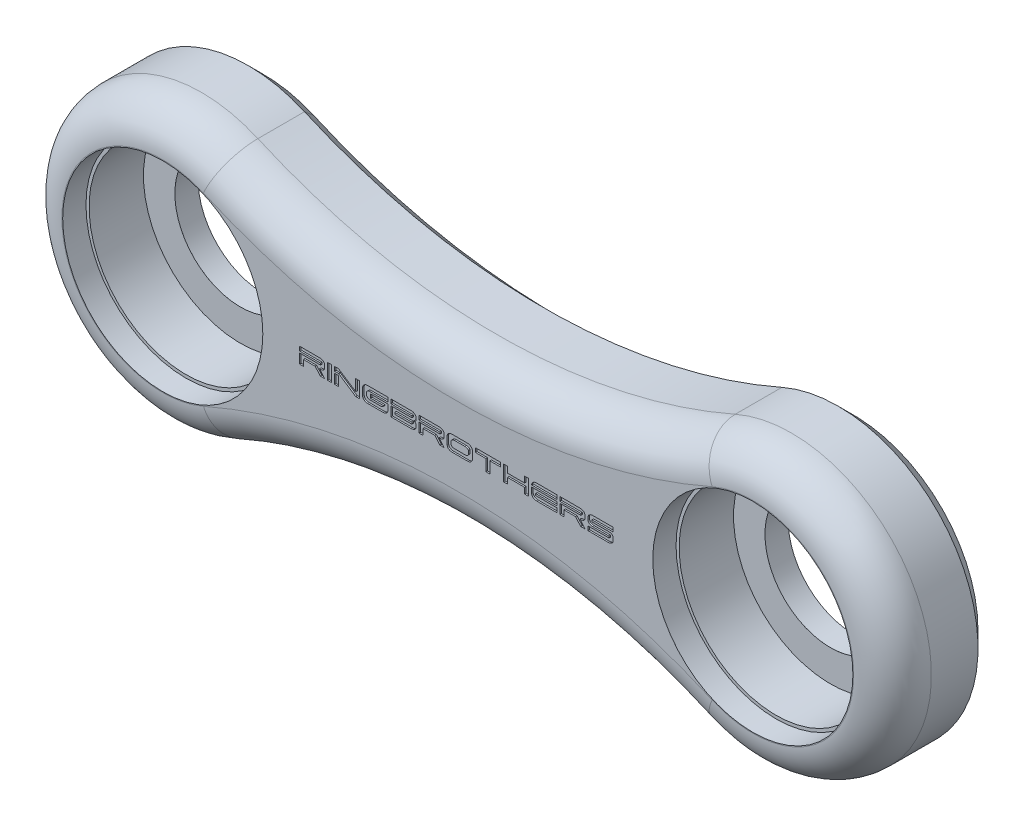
from build123d import *

# Parameters (mm, degrees)
SKETCH1_R                       = 5.3594
MAIN_BODY_DOG_BONE_DEPTH        = 8.255
SKETCH2_R                       = 7.93115
R4ZZ_BEARIN_BORE_3_DEEP_DEPTH   = 6.35
SKETCH3_R                       = 8.18515
F_105_DEEP_CLEARANCE_BORE_DEPTH = 1.905
F_02_X_45_DEG_CHAMFERS_SIZE     = 0.000254
F_125_FILLETS_R                 = 3.175
CHAMFER1_SIZE                   = 1.27
EXTRUDE2_DEPTH                  = 0.127


with BuildPart() as part:
    # Sketch1 → Main Body Dog Bone (new body)
    with BuildSketch(Plane.XY):
        with BuildLine():
            ThreePointArc((4.608381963, 10.459814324), (-11.43, 0), (4.608381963, -10.459814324))
            ThreePointArc((4.608381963, -10.459814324), (24.13, -6.35), (43.651618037, -10.459814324))
            ThreePointArc((43.651618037, -10.459814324), (59.69, 0), (43.651618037, 10.459814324))
            ThreePointArc((43.651618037, 10.459814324), (24.13, 6.35), (4.608381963, 10.459814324))
        make_face()
        Circle(SKETCH1_R, mode=Mode.SUBTRACT)
        with Locations((48.26, 0)):
            Circle(SKETCH1_R, mode=Mode.SUBTRACT)
    extrude(amount=-MAIN_BODY_DOG_BONE_DEPTH)

    # Sketch2 → R4ZZ bearin bore .3_ deep (cut)
    with BuildSketch(Plane.XY):
        Circle(SKETCH2_R)
        with Locations((48.26, 0)):
            Circle(SKETCH2_R)
    extrude(amount=-R4ZZ_BEARIN_BORE_3_DEEP_DEPTH, mode=Mode.SUBTRACT)

    # Sketch3 → 105_ deep Clearance Bore (cut)
    with BuildSketch(Plane.XY):
        Circle(SKETCH3_R)
        with Locations((48.26, 0)):
            Circle(SKETCH3_R)
    extrude(amount=-F_105_DEEP_CLEARANCE_BORE_DEPTH, mode=Mode.SUBTRACT)

    # 02_ x 45 deg chamfers
    f_02_x_45_deg_chamfers_edges = [part.edges().sort_by_distance(p)[0] for p in [
        (-5.3594, 0, -8.255),
        (42.9006, 0, -8.255),
        (-5.3594, 0, -6.35),
        (42.9006, 0, -6.35),
        (-8.18515, 0, 0),
        (40.07485, 0, 0),
    ]]
    chamfer(f_02_x_45_deg_chamfers_edges, length=F_02_X_45_DEG_CHAMFERS_SIZE)

    # 125_ Fillets
    f_125_fillets_edges = [part.edges().sort_by_distance(p)[0] for p in [
        (59.69, 0, 0),
        (24.13, -6.35, 0),
        (-11.43, 0, 0),
        (24.13, 6.35, 0),
    ]]
    fillet(f_125_fillets_edges, radius=F_125_FILLETS_R)

    # Chamfer1
    chamfer1_edges = [part.edges().sort_by_distance(p)[0] for p in [
        (24.13, -6.35, -8.255),
        (59.69, 0, -8.255),
        (24.13, 6.35, -8.255),
        (-11.43, 0, -8.255),
    ]]
    chamfer(chamfer1_edges, length=CHAMFER1_SIZE)

    # Sketch5 → Extrude2 (cut)
    # profile 1 of 14: a face of its own
    with BuildSketch(Plane.XY):
        with BuildLine():
            Line((12.466708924, -0.146319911), (11.506711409, -0.146319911))
            Line((11.506711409, -0.146319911), (11.506711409, -0.290272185))
            Line((11.506711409, -0.290272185), (11.506711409, -0.635))
            Line((11.506711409, -0.635), (11.179346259, -0.635))
            Line((11.179346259, -0.635), (11.179346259, -0.318683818))
            Line((11.179346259, -0.318683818), (11.179346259, 0.1548434))
            Line((11.179346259, 0.1548434), (12.898881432, 0.1548434))
            Line((12.898881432, 0.1548434), (12.898881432, 0.298795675))
            Line((12.898881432, 0.298795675), (11.179346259, 0.298795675))
            Line((11.179346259, 0.298795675), (11.179346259, 0.635))
            Line((11.179346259, 0.635), (11.591630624, 0.635))
            Line((11.591630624, 0.635), (12.826905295, 0.632790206))
            add(Edge.make_bspline(
                [(12.826905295, 0.632790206), (12.841328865, 0.632663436), (12.869589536, 0.632415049), (12.911034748, 0.628849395), (12.950727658, 0.622943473), (12.988578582, 0.614232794), (13.024483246, 0.602324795), (13.058730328, 0.588280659), (13.090954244, 0.571066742), (13.121384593, 0.551623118), (13.149139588, 0.529418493), (13.173383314, 0.50430363), (13.193784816, 0.476450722), (13.210724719, 0.446104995), (13.223099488, 0.41277572), (13.232892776, 0.377251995), (13.238049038, 0.338827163), (13.238802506, 0.312383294), (13.239189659, 0.298795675)],
                knots=[0, 0, 0, 0, 1.152257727, 2.257664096, 3.320814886, 4.356953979, 5.356767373, 6.340576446, 7.311035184, 8.2719758, 9.22274549, 10.144516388, 11.052686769, 11.974764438, 12.91171314, 13.886678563, 14.914114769, 16, 16, 16, 16], degree=3))
            Line((13.239189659, 0.298795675), (13.239189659, 0.1548434))
            add(Edge.make_bspline(
                [(13.239189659, 0.1548434), (13.238947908, 0.141564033), (13.238479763, 0.115848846), (13.233161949, 0.078898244), (13.225591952, 0.044798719), (13.214140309, 0.013775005), (13.19921045, -0.014035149), (13.181486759, -0.039181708), (13.159948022, -0.060743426), (13.13545111, -0.079597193), (13.107473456, -0.095218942), (13.076781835, -0.109372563), (13.042447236, -0.120408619), (13.00512119, -0.12987551), (12.964642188, -0.137447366), (12.920885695, -0.142713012), (12.873884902, -0.145888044), (12.84143201, -0.146172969), (12.824695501, -0.146319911)],
                knots=[0, 0, 0, 0, 1.081306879, 2.093925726, 3.036167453, 3.923384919, 4.778872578, 5.602256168, 6.420848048, 7.252672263, 8.11313074, 9.02648445, 10.002685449, 11.046731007, 12.163464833, 13.355767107, 14.636324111, 16, 16, 16, 16], degree=3))
            Line((12.824695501, -0.146319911), (13.239189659, -0.635))
            Line((13.239189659, -0.635), (12.881203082, -0.635))
            Line((12.881203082, -0.635), (12.466708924, -0.146319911))
        make_face()
    # profile 2 of 14: a face of its own
    with BuildSketch(Plane.XY):
        Polygon((13.8099478, -0.635), (13.48258265, -0.635), (13.48258265, 0.298795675), (13.48258265, 0.635), (13.8099478, 0.635), (13.8099478, 0.298795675), (13.8099478, 0.159262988), (13.8099478, -0.115698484), align=None)
    # profile 3 of 14: a face of its own
    with BuildSketch(Plane.XY):
        Polygon((14.384178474, 0.635), (14.048289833, 0.635), (14.048289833, 0.298795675), (14.380074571, 0.298795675), (15.780768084, -0.635), (16.108133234, -0.635), (16.108133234, -0.318683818), (16.108133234, 0.635), (15.780768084, 0.635), (15.780768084, 0.146004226), (15.780768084, -0.290272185), align=None)
    # profile 4 of 14: a face of its own
    with BuildSketch(Plane.XY):
        Polygon((14.375654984, 0.146004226), (14.375654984, -0.168102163), (14.375654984, -0.635), (14.048289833, -0.635), (14.048289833, 0.146004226), align=None)
    # profile 5 of 14: a face of its own
    with BuildSketch(Plane.XY):
        with BuildLine():
            Line((18.411369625, 0.1548434), (18.411369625, -0.146319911))
            Line((18.411369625, -0.146319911), (18.411369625, -0.318683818))
            add(Edge.make_bspline(
                [(18.411369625, -0.318683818), (18.411038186, -0.329448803), (18.410386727, -0.350607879), (18.404217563, -0.381682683), (18.395457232, -0.411808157), (18.38164896, -0.440359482), (18.36515046, -0.468162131), (18.343673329, -0.493958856), (18.319592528, -0.519418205), (18.291415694, -0.542814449), (18.260868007, -0.564277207), (18.228523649, -0.583541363), (18.194254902, -0.5992309), (18.158322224, -0.612192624), (18.120904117, -0.622661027), (18.08171987, -0.62995919), (18.040944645, -0.633954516), (18.013194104, -0.634647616), (17.99908526, -0.635)],
                knots=[0, 0, 0, 0, 0.896373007, 1.761862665, 2.633245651, 3.504540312, 4.398247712, 5.321687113, 6.295784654, 7.31682771, 8.368284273, 9.406444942, 10.45051942, 11.505082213, 12.588443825, 13.686201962, 14.823625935, 16, 16, 16, 16], degree=3))
            Line((17.99908526, -0.635), (16.763810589, -0.635))
            add(Edge.make_bspline(
                [(16.763810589, -0.635), (16.749701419, -0.634648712), (16.721950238, -0.633957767), (16.68117964, -0.629946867), (16.642078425, -0.622723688), (16.604720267, -0.612064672), (16.568716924, -0.599313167), (16.534375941, -0.583530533), (16.502026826, -0.564280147), (16.47148042, -0.542813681), (16.443303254, -0.519418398), (16.419222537, -0.493958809), (16.397745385, -0.468162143), (16.38124689, -0.440359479), (16.367438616, -0.411808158), (16.358678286, -0.381682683), (16.352509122, -0.350607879), (16.351857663, -0.329448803), (16.351526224, -0.318683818)],
                knots=[0, 0, 0, 0, 1.176388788, 2.313826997, 3.411598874, 4.486522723, 5.549349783, 6.593437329, 7.631610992, 8.683080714, 9.70413655, 10.678246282, 11.601697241, 12.495415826, 13.366721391, 14.238115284, 15.103615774, 16, 16, 16, 16], degree=3))
            Line((16.351526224, -0.318683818), (16.351526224, 0.318683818))
            add(Edge.make_bspline(
                [(16.351526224, 0.318683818), (16.351869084, 0.329446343), (16.35254629, 0.350704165), (16.358576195, 0.381814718), (16.367519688, 0.411885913), (16.381219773, 0.440377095), (16.397860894, 0.468173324), (16.419003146, 0.494257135), (16.443437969, 0.519395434), (16.471458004, 0.542836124), (16.502035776, 0.564265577), (16.534362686, 0.583565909), (16.56879449, 0.599199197), (16.60459244, 0.612570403), (16.642146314, 0.622591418), (16.681168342, 0.629985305), (16.721953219, 0.633947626), (16.749702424, 0.634645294), (16.763810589, 0.635)],
                knots=[0, 0, 0, 0, 0.896302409, 1.770350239, 2.633278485, 3.504504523, 4.398141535, 5.328358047, 6.296077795, 7.317040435, 8.368414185, 9.406493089, 10.450485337, 11.516216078, 12.588712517, 13.686384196, 14.823718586, 16, 16, 16, 16], degree=3))
            Line((16.763810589, 0.635), (18.411369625, 0.635))
            Line((18.411369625, 0.635), (18.411369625, 0.298795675))
            Line((18.411369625, 0.298795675), (16.95606264, 0.298795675))
            add(Edge.make_bspline(
                [(16.95606264, 0.298795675), (16.937494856, 0.298252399), (16.901677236, 0.297204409), (16.850312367, 0.287407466), (16.803291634, 0.272219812), (16.768136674, 0.253662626), (16.743582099, 0.236143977), (16.727167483, 0.222923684), (16.713342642, 0.208782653), (16.701753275, 0.193937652), (16.692144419, 0.17874402), (16.685564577, 0.162425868), (16.680553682, 0.145858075), (16.679443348, 0.134358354), (16.678891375, 0.128641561)],
                knots=[0, 0, 0, 0, 1.881895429, 3.630213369, 5.284379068, 6.87940937, 7.637661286, 8.342963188, 9.014833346, 9.638406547, 10.251752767, 10.830688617, 11.41870675, 12, 12, 12, 12], degree=3))
            Line((16.678891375, 0.128641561), (16.678891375, -0.115698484))
            add(Edge.make_bspline(
                [(16.678891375, -0.115698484), (16.679128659, -0.121403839), (16.679604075, -0.132834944), (16.683638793, -0.149584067), (16.68957197, -0.16591869), (16.698364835, -0.18154685), (16.709428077, -0.196757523), (16.723156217, -0.211202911), (16.739053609, -0.225230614), (16.763817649, -0.242937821), (16.798777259, -0.262608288), (16.846391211, -0.278267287), (16.89845735, -0.288849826), (16.934959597, -0.289787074), (16.953852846, -0.290272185)],
                knots=[0, 0, 0, 0, 0.573398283, 1.148846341, 1.725170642, 2.317613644, 2.946685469, 3.613486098, 4.318780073, 5.07709292, 6.674419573, 8.332103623, 10.101528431, 12, 12, 12, 12], degree=3))
            Line((16.953852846, -0.290272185), (17.81346259, -0.290272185))
            add(Edge.make_bspline(
                [(17.81346259, -0.290272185), (17.830337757, -0.289756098), (17.862829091, -0.288762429), (17.909514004, -0.280336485), (17.952163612, -0.266997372), (17.989944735, -0.248035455), (18.022068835, -0.225635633), (18.046568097, -0.199935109), (18.064453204, -0.172316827), (18.068888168, -0.151903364), (18.071061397, -0.141900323)],
                knots=[0, 0, 0, 0, 1.261479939, 2.428845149, 3.536646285, 4.592759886, 5.580130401, 6.448744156, 7.239850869, 8, 8, 8, 8], degree=3))
            Line((18.071061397, -0.141900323), (16.984158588, -0.141900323))
            Line((16.984158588, -0.141900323), (16.984158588, 0.1548434))
            Line((16.984158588, 0.1548434), (18.258578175, 0.1548434))
            Line((18.258578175, 0.1548434), (18.411369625, 0.1548434))
        make_face()
    # profile 6 of 14: a face of its own
    with BuildSketch(Plane.XY):
        with BuildLine():
            Line((18.982127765, 0.1548434), (20.374297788, 0.1548434))
            Line((20.374297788, 0.1548434), (20.374297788, 0.298795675))
            Line((20.374297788, 0.298795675), (18.654762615, 0.298795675))
            Line((18.654762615, 0.298795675), (18.654762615, 0.635))
            Line((18.654762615, 0.635), (19.06704698, 0.635))
            Line((19.06704698, 0.635), (20.302321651, 0.632790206))
            add(Edge.make_bspline(
                [(20.302321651, 0.632790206), (20.316745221, 0.632663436), (20.345005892, 0.632415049), (20.386451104, 0.628849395), (20.426144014, 0.622943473), (20.463994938, 0.614232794), (20.499899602, 0.602324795), (20.534146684, 0.588280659), (20.5663706, 0.571066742), (20.596800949, 0.551623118), (20.624555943, 0.529418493), (20.64879967, 0.50430363), (20.669201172, 0.476450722), (20.686141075, 0.446104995), (20.698515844, 0.41277572), (20.708309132, 0.377251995), (20.713465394, 0.338827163), (20.714218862, 0.312383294), (20.714606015, 0.298795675)],
                knots=[0, 0, 0, 0, 1.152257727, 2.257664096, 3.320814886, 4.356953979, 5.356767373, 6.340576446, 7.311035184, 8.2719758, 9.22274549, 10.144516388, 11.052686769, 11.974764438, 12.91171314, 13.886678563, 14.914114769, 16, 16, 16, 16], degree=3))
            Line((20.714606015, 0.298795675), (20.714606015, 0.1548434))
            add(Edge.make_bspline(
                [(20.714606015, 0.1548434), (20.713283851, 0.144627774), (20.710684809, 0.124546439), (20.698652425, 0.096359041), (20.680958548, 0.070868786), (20.656587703, 0.048527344), (20.626098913, 0.029505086), (20.589991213, 0.012672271), (20.547678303, -0.001137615), (20.517063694, -0.007519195), (20.500887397, -0.010891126)],
                knots=[0, 0, 0, 0, 0.842959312, 1.657044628, 2.489338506, 3.376375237, 4.352527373, 5.43168877, 6.642943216, 8, 8, 8, 8], degree=3))
            add(Edge.make_bspline(
                [(20.500887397, -0.010891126), (20.517032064, -0.012567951), (20.547453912, -0.015727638), (20.589789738, -0.025051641), (20.625942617, -0.038059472), (20.656610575, -0.053818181), (20.680865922, -0.074007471), (20.698857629, -0.097725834), (20.710746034, -0.125044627), (20.713296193, -0.144731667), (20.714606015, -0.1548434)],
                knots=[0, 0, 0, 0, 1.376877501, 2.59448896, 3.668020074, 4.630952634, 5.505695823, 6.321954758, 7.138115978, 8, 8, 8, 8], degree=3))
            Line((20.714606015, -0.1548434), (20.714606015, -0.29911136))
            add(Edge.make_bspline(
                [(20.714606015, -0.29911136), (20.714229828, -0.312701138), (20.713500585, -0.339045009), (20.708210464, -0.37743862), (20.698648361, -0.412924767), (20.686051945, -0.446176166), (20.669212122, -0.476454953), (20.648796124, -0.504301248), (20.624559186, -0.529423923), (20.596791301, -0.551603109), (20.566327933, -0.571192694), (20.533807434, -0.588095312), (20.499600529, -0.602855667), (20.463247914, -0.614326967), (20.425273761, -0.624060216), (20.385064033, -0.629993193), (20.343249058, -0.634423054), (20.314646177, -0.634805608), (20.300111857, -0.635)],
                knots=[0, 0, 0, 0, 1.081878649, 2.097228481, 3.076691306, 4.002368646, 4.921044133, 5.825863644, 6.744233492, 7.691495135, 8.648890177, 9.623180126, 10.606611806, 11.610701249, 12.655082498, 13.723875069, 14.843405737, 16, 16, 16, 16], degree=3))
            Line((20.300111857, -0.635), (19.06704698, -0.635))
            Line((19.06704698, -0.635), (18.654762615, -0.635))
            Line((18.654762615, -0.635), (18.654762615, 0.1548434))
            Line((18.654762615, 0.1548434), (18.982127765, 0.1548434))
        make_face()
        Polygon((20.374297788, -0.146319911), (19.139023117, -0.146319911), (18.982127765, -0.146319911), (18.982127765, -0.29911136), (19.678212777, -0.29911136), (20.374297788, -0.29911136), align=None, mode=Mode.SUBTRACT)
    # profile 7 of 14: a face of its own
    with BuildSketch(Plane.XY):
        with BuildLine():
            Line((22.24536167, -0.146319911), (21.285364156, -0.146319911))
            Line((21.285364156, -0.146319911), (21.285364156, -0.290272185))
            Line((21.285364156, -0.290272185), (21.285364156, -0.635))
            Line((21.285364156, -0.635), (20.957999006, -0.635))
            Line((20.957999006, -0.635), (20.957999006, -0.318683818))
            Line((20.957999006, -0.318683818), (20.957999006, 0.1548434))
            Line((20.957999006, 0.1548434), (22.677534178, 0.1548434))
            Line((22.677534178, 0.1548434), (22.677534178, 0.298795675))
            Line((22.677534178, 0.298795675), (20.957999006, 0.298795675))
            Line((20.957999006, 0.298795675), (20.957999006, 0.635))
            Line((20.957999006, 0.635), (21.370283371, 0.635))
            Line((21.370283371, 0.635), (22.605558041, 0.632790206))
            add(Edge.make_bspline(
                [(22.605558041, 0.632790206), (22.619981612, 0.632663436), (22.648242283, 0.632415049), (22.689687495, 0.628849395), (22.729380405, 0.622943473), (22.767231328, 0.614232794), (22.803135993, 0.602324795), (22.837383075, 0.588280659), (22.869606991, 0.571066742), (22.900037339, 0.551623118), (22.927792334, 0.529418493), (22.95203606, 0.50430363), (22.972437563, 0.476450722), (22.989377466, 0.446104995), (23.001752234, 0.41277572), (23.011545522, 0.377251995), (23.016701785, 0.338827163), (23.017455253, 0.312383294), (23.017842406, 0.298795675)],
                knots=[0, 0, 0, 0, 1.152257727, 2.257664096, 3.320814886, 4.356953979, 5.356767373, 6.340576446, 7.311035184, 8.2719758, 9.22274549, 10.144516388, 11.052686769, 11.974764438, 12.91171314, 13.886678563, 14.914114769, 16, 16, 16, 16], degree=3))
            Line((23.017842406, 0.298795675), (23.017842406, 0.1548434))
            add(Edge.make_bspline(
                [(23.017842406, 0.1548434), (23.017600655, 0.141564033), (23.01713251, 0.115848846), (23.011814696, 0.078898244), (23.004244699, 0.044798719), (22.992793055, 0.013775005), (22.977863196, -0.014035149), (22.960139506, -0.039181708), (22.938600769, -0.060743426), (22.914103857, -0.079597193), (22.886126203, -0.095218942), (22.855434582, -0.109372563), (22.821099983, -0.120408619), (22.783773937, -0.12987551), (22.743294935, -0.137447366), (22.699538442, -0.142713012), (22.652537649, -0.145888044), (22.620084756, -0.146172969), (22.603348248, -0.146319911)],
                knots=[0, 0, 0, 0, 1.081306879, 2.093925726, 3.036167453, 3.923384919, 4.778872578, 5.602256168, 6.420848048, 7.252672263, 8.11313074, 9.02648445, 10.002685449, 11.046731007, 12.163464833, 13.355767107, 14.636324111, 16, 16, 16, 16], degree=3))
            Line((22.603348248, -0.146319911), (23.017842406, -0.635))
            Line((23.017842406, -0.635), (22.659855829, -0.635))
            Line((22.659855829, -0.635), (22.24536167, -0.146319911))
        make_face()
    # profile 8 of 14: a face of its own
    with BuildSketch(Plane.XY):
        with BuildLine():
            Line((23.261235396, -0.318683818), (23.261235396, 0.318683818))
            add(Edge.make_bspline(
                [(23.261235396, 0.318683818), (23.261578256, 0.329446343), (23.262255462, 0.350704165), (23.268285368, 0.381814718), (23.27722886, 0.411885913), (23.290928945, 0.440377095), (23.307570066, 0.468173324), (23.328712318, 0.494257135), (23.353147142, 0.519395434), (23.381167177, 0.542836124), (23.411744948, 0.564265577), (23.444071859, 0.583565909), (23.478503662, 0.599199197), (23.514301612, 0.612570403), (23.551855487, 0.622591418), (23.590877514, 0.629985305), (23.631662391, 0.633947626), (23.659411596, 0.634645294), (23.673519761, 0.635)],
                knots=[0, 0, 0, 0, 0.896302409, 1.770350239, 2.633278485, 3.504504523, 4.398141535, 5.328358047, 6.296077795, 7.317040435, 8.368414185, 9.406493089, 10.450485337, 11.516216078, 12.588712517, 13.686384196, 14.823718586, 16, 16, 16, 16], degree=3))
            Line((23.673519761, 0.635), (24.908794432, 0.632790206))
            add(Edge.make_bspline(
                [(24.908794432, 0.632790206), (24.92290228, 0.632434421), (24.95065086, 0.631734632), (24.991440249, 0.627787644), (25.030545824, 0.620319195), (25.068159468, 0.610488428), (25.103885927, 0.596907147), (25.138246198, 0.581367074), (25.170568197, 0.562052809), (25.201147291, 0.540627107), (25.229166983, 0.517185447), (25.253601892, 0.49204739), (25.274744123, 0.465963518), (25.291385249, 0.438167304), (25.305085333, 0.409676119), (25.314028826, 0.379604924), (25.320058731, 0.348494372), (25.320735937, 0.327236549), (25.321078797, 0.316474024)],
                knots=[0, 0, 0, 0, 1.176263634, 2.313580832, 3.411235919, 4.492184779, 5.54967263, 6.593649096, 7.63171231, 8.683070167, 9.704017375, 10.671722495, 11.601924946, 12.49554845, 13.366761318, 14.229676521, 15.103711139, 16, 16, 16, 16], degree=3))
            Line((25.321078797, 0.316474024), (25.321078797, -0.318683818))
            add(Edge.make_bspline(
                [(25.321078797, -0.318683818), (25.320747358, -0.329448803), (25.320095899, -0.350607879), (25.313926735, -0.381682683), (25.305166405, -0.411808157), (25.291358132, -0.440359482), (25.274859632, -0.468162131), (25.253382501, -0.493958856), (25.2293017, -0.519418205), (25.201124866, -0.542814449), (25.170577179, -0.564277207), (25.138232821, -0.583541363), (25.103964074, -0.5992309), (25.068031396, -0.612192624), (25.03061329, -0.622661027), (24.991429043, -0.62995919), (24.950653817, -0.633954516), (24.922903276, -0.634647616), (24.908794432, -0.635)],
                knots=[0, 0, 0, 0, 0.896373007, 1.761862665, 2.633245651, 3.504540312, 4.398247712, 5.321687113, 6.295784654, 7.31682771, 8.368284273, 9.406444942, 10.45051942, 11.505082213, 12.588443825, 13.686201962, 14.823625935, 16, 16, 16, 16], degree=3))
            Line((24.908794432, -0.635), (23.673519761, -0.635))
            add(Edge.make_bspline(
                [(23.673519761, -0.635), (23.659410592, -0.634648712), (23.631659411, -0.633957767), (23.590888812, -0.629946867), (23.551787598, -0.622723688), (23.514429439, -0.612064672), (23.478426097, -0.599313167), (23.444085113, -0.583530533), (23.411735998, -0.564280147), (23.381189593, -0.542813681), (23.353012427, -0.519418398), (23.328931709, -0.493958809), (23.307454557, -0.468162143), (23.290956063, -0.440359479), (23.277147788, -0.411808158), (23.268387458, -0.381682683), (23.262218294, -0.350607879), (23.261566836, -0.329448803), (23.261235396, -0.318683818)],
                knots=[0, 0, 0, 0, 1.176388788, 2.313826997, 3.411598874, 4.486522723, 5.549349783, 6.593437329, 7.631610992, 8.683080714, 9.70413655, 10.678246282, 11.601697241, 12.495415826, 13.366721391, 14.238115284, 15.103615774, 16, 16, 16, 16], degree=3))
        make_face()
        with BuildLine():
            Line((24.99592344, -0.111278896), (24.99592344, 0.133061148))
            add(Edge.make_bspline(
                [(24.99592344, 0.133061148), (24.992636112, 0.143910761), (24.985929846, 0.166044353), (24.965678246, 0.196308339), (24.93848446, 0.2244962), (24.903994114, 0.250020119), (24.863728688, 0.272288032), (24.81736365, 0.287481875), (24.766407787, 0.297215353), (24.730691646, 0.298255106), (24.712122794, 0.298795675)],
                knots=[0, 0, 0, 0, 0.768521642, 1.567811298, 2.449901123, 3.427540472, 4.479494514, 5.569722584, 6.736496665, 8, 8, 8, 8], degree=3))
            Line((24.712122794, 0.298795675), (23.865771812, 0.298795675))
            add(Edge.make_bspline(
                [(23.865771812, 0.298795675), (23.847204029, 0.298252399), (23.811386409, 0.297204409), (23.760021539, 0.287407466), (23.713000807, 0.272219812), (23.677845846, 0.253662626), (23.653291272, 0.236143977), (23.636876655, 0.222923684), (23.623051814, 0.208782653), (23.611462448, 0.193937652), (23.601853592, 0.17874402), (23.595273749, 0.162425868), (23.590262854, 0.145858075), (23.589152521, 0.134358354), (23.588600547, 0.128641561)],
                knots=[0, 0, 0, 0, 1.881895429, 3.630213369, 5.284379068, 6.87940937, 7.637661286, 8.342963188, 9.014833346, 9.638406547, 10.251752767, 10.830688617, 11.41870675, 12, 12, 12, 12], degree=3))
            Line((23.588600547, 0.128641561), (23.588600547, -0.115698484))
            add(Edge.make_bspline(
                [(23.588600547, -0.115698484), (23.588837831, -0.121403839), (23.589313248, -0.132834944), (23.593347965, -0.149584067), (23.599281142, -0.16591869), (23.608074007, -0.18154685), (23.61913725, -0.196757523), (23.632865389, -0.211202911), (23.648762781, -0.225230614), (23.673526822, -0.242937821), (23.708486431, -0.262608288), (23.756100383, -0.278267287), (23.808166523, -0.288849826), (23.84466877, -0.289787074), (23.863562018, -0.290272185)],
                knots=[0, 0, 0, 0, 0.573398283, 1.148846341, 1.725170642, 2.317613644, 2.946685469, 3.613486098, 4.318780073, 5.07709292, 6.674419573, 8.332103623, 10.101528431, 12, 12, 12, 12], degree=3))
            Line((23.863562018, -0.290272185), (24.712122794, -0.290272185))
            add(Edge.make_bspline(
                [(24.712122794, -0.290272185), (24.730789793, -0.289584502), (24.767128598, -0.288245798), (24.819718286, -0.278450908), (24.868261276, -0.261642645), (24.904964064, -0.242029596), (24.931407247, -0.223976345), (24.948361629, -0.209401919), (24.96313919, -0.194557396), (24.975150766, -0.179112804), (24.984731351, -0.163091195), (24.990753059, -0.146195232), (24.99533057, -0.128986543), (24.99572511, -0.117202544), (24.99592344, -0.111278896)],
                knots=[0, 0, 0, 0, 1.828309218, 3.55914573, 5.21872565, 6.842175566, 7.620050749, 8.351374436, 9.02937863, 9.668653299, 10.264559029, 10.848574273, 11.421194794, 12, 12, 12, 12], degree=3))
        make_face(mode=Mode.SUBTRACT)
    # profile 9 of 14: a face of its own
    with BuildSketch(Plane.XY):
        Polygon((26.751446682, -0.635), (26.424081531, -0.635), (26.424081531, 0.298795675), (26.053151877, 0.298795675), (25.564471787, 0.298795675), (25.564471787, 0.635), (25.976756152, 0.635), (27.212030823, 0.632790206), (27.624315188, 0.635), (27.624315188, 0.298795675), (26.751446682, 0.298795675), align=None)
    # profile 10 of 14: a face of its own
    with BuildSketch(Plane.XY):
        Polygon((29.430032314, 0.146004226), (29.600186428, 0.146004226), (29.600186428, 0.635), (29.927551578, 0.635), (29.927551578, -0.318683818), (29.927551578, -0.635), (29.600186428, -0.635), (29.600186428, -0.1548434), (28.592204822, -0.1548434), (28.195073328, -0.1548434), (28.195073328, -0.635), (27.867708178, -0.635), (27.867708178, 0.298795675), (27.867708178, 0.635), (28.195073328, 0.635), (28.195073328, 0.298795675), (28.195073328, 0.146004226), (28.544220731, 0.146004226), (29.305652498, 0.146004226), align=None)
    # profile 11 of 14: a face of its own
    with BuildSketch(Plane.XY):
        with BuildLine():
            Line((31.94288342, -0.290272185), (32.230787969, -0.290272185))
            Line((32.230787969, -0.290272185), (32.230787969, -0.635))
            Line((32.230787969, -0.635), (31.818503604, -0.635))
            Line((31.818503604, -0.635), (30.583228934, -0.635))
            add(Edge.make_bspline(
                [(30.583228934, -0.635), (30.569119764, -0.634648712), (30.541368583, -0.633957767), (30.500597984, -0.629946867), (30.46149677, -0.622723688), (30.424138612, -0.612064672), (30.388135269, -0.599313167), (30.353794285, -0.583530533), (30.321445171, -0.564280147), (30.290898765, -0.542813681), (30.262721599, -0.519418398), (30.238640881, -0.493958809), (30.217163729, -0.468162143), (30.200665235, -0.440359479), (30.186856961, -0.411808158), (30.178096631, -0.381682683), (30.171927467, -0.350607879), (30.171276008, -0.329448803), (30.170944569, -0.318683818)],
                knots=[0, 0, 0, 0, 1.176388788, 2.313826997, 3.411598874, 4.486522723, 5.549349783, 6.593437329, 7.631610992, 8.683080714, 9.70413655, 10.678246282, 11.601697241, 12.495415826, 13.366721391, 14.238115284, 15.103615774, 16, 16, 16, 16], degree=3))
            Line((30.170944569, -0.318683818), (30.170944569, 0.1548434))
            Line((30.170944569, 0.1548434), (32.230787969, 0.1548434))
            Line((32.230787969, 0.1548434), (32.230787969, -0.146319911))
            Line((32.230787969, -0.146319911), (30.498309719, -0.146319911))
            Line((30.498309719, -0.146319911), (30.498309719, -0.290272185))
            Line((30.498309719, -0.290272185), (30.773271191, -0.290272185))
            Line((30.773271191, -0.290272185), (31.632880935, -0.290272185))
            Line((31.632880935, -0.290272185), (31.94288342, -0.290272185))
        make_face()
    # profile 12 of 14: a face of its own
    with BuildSketch(Plane.XY):
        with BuildLine():
            Line((30.170944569, 0.298795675), (30.170944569, 0.318683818))
            add(Edge.make_bspline(
                [(30.170944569, 0.318683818), (30.171287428, 0.329446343), (30.171964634, 0.350704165), (30.17799454, 0.381814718), (30.186938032, 0.411885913), (30.200638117, 0.440377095), (30.217279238, 0.468173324), (30.23842149, 0.494257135), (30.262856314, 0.519395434), (30.290876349, 0.542836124), (30.32145412, 0.564265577), (30.353781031, 0.583565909), (30.388212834, 0.599199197), (30.424010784, 0.612570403), (30.461564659, 0.622591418), (30.500586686, 0.629985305), (30.541371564, 0.633947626), (30.569120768, 0.634645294), (30.583228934, 0.635)],
                knots=[0, 0, 0, 0, 0.896302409, 1.770350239, 2.633278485, 3.504504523, 4.398141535, 5.328358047, 6.296077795, 7.317040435, 8.368414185, 9.406493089, 10.450485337, 11.516216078, 12.588712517, 13.686384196, 14.823718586, 16, 16, 16, 16], degree=3))
            Line((30.583228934, 0.635), (31.818503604, 0.632790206))
            Line((31.818503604, 0.632790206), (32.230787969, 0.635))
            Line((32.230787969, 0.635), (32.230787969, 0.298795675))
            Line((32.230787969, 0.298795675), (30.775480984, 0.298795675))
            Line((30.775480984, 0.298795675), (30.659624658, 0.298795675))
            Line((30.659624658, 0.298795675), (30.170944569, 0.298795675))
        make_face()
    # profile 13 of 14: a face of its own
    with BuildSketch(Plane.XY):
        with BuildLine():
            Line((33.761543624, -0.146319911), (32.80154611, -0.146319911))
            Line((32.80154611, -0.146319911), (32.80154611, -0.290272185))
            Line((32.80154611, -0.290272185), (32.80154611, -0.635))
            Line((32.80154611, -0.635), (32.474180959, -0.635))
            Line((32.474180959, -0.635), (32.474180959, -0.318683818))
            Line((32.474180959, -0.318683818), (32.474180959, 0.1548434))
            Line((32.474180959, 0.1548434), (34.193716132, 0.1548434))
            Line((34.193716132, 0.1548434), (34.193716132, 0.298795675))
            Line((34.193716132, 0.298795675), (32.474180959, 0.298795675))
            Line((32.474180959, 0.298795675), (32.474180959, 0.635))
            Line((32.474180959, 0.635), (32.886465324, 0.635))
            Line((32.886465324, 0.635), (34.121739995, 0.632790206))
            add(Edge.make_bspline(
                [(34.121739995, 0.632790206), (34.136163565, 0.632663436), (34.164424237, 0.632415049), (34.205869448, 0.628849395), (34.245562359, 0.622943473), (34.283413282, 0.614232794), (34.319317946, 0.602324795), (34.353565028, 0.588280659), (34.385788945, 0.571066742), (34.416219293, 0.551623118), (34.443974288, 0.529418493), (34.468218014, 0.50430363), (34.488619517, 0.476450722), (34.50555942, 0.446104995), (34.517934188, 0.41277572), (34.527727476, 0.377251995), (34.532883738, 0.338827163), (34.533637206, 0.312383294), (34.53402436, 0.298795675)],
                knots=[0, 0, 0, 0, 1.152257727, 2.257664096, 3.320814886, 4.356953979, 5.356767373, 6.340576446, 7.311035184, 8.2719758, 9.22274549, 10.144516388, 11.052686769, 11.974764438, 12.91171314, 13.886678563, 14.914114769, 16, 16, 16, 16], degree=3))
            Line((34.53402436, 0.298795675), (34.53402436, 0.1548434))
            add(Edge.make_bspline(
                [(34.53402436, 0.1548434), (34.533782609, 0.141564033), (34.533314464, 0.115848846), (34.52799665, 0.078898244), (34.520426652, 0.044798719), (34.508975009, 0.013775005), (34.49404515, -0.014035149), (34.47632146, -0.039181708), (34.454782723, -0.060743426), (34.430285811, -0.079597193), (34.402308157, -0.095218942), (34.371616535, -0.109372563), (34.337281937, -0.120408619), (34.299955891, -0.12987551), (34.259476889, -0.137447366), (34.215720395, -0.142713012), (34.168719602, -0.145888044), (34.13626671, -0.146172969), (34.119530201, -0.146319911)],
                knots=[0, 0, 0, 0, 1.081306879, 2.093925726, 3.036167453, 3.923384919, 4.778872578, 5.602256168, 6.420848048, 7.252672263, 8.11313074, 9.02648445, 10.002685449, 11.046731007, 12.163464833, 13.355767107, 14.636324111, 16, 16, 16, 16], degree=3))
            Line((34.119530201, -0.146319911), (34.53402436, -0.635))
            Line((34.53402436, -0.635), (34.176037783, -0.635))
            Line((34.176037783, -0.635), (33.761543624, -0.146319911))
        make_face()
    # profile 14 of 14: a face of its own
    with BuildSketch(Plane.XY):
        with BuildLine():
            Line((34.77741735, 0.233448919), (34.77741735, 0.146004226))
            add(Edge.make_bspline(
                [(34.77741735, 0.146004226), (34.778111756, 0.133980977), (34.779460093, 0.110635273), (34.785620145, 0.076894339), (34.794629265, 0.045340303), (34.807418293, 0.016141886), (34.82318699, -0.010875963), (34.842403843, -0.035499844), (34.864914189, -0.057660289), (34.890736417, -0.077230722), (34.919387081, -0.094595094), (34.950420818, -0.109951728), (34.984011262, -0.12305091), (35.019994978, -0.133534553), (35.058424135, -0.142521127), (35.099242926, -0.149057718), (35.142592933, -0.153091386), (35.172225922, -0.154247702), (35.187491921, -0.1548434)],
                knots=[0, 0, 0, 0, 1.011564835, 1.964169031, 2.876707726, 3.764119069, 4.636456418, 5.499958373, 6.381930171, 7.284250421, 8.217267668, 9.194404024, 10.191516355, 11.243838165, 12.342470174, 13.507338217, 14.715857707, 16, 16, 16, 16], degree=3))
            Line((35.187491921, -0.1548434), (36.496952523, -0.1548434))
            Line((36.496952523, -0.1548434), (36.496952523, -0.29911136))
            Line((36.496952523, -0.29911136), (34.77741735, -0.29911136))
            Line((34.77741735, -0.29911136), (34.77741735, -0.635))
            Line((34.77741735, -0.635), (35.189701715, -0.635))
            Line((35.189701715, -0.635), (36.422766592, -0.635))
            add(Edge.make_bspline(
                [(36.422766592, -0.635), (36.437300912, -0.634805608), (36.465903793, -0.634423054), (36.507718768, -0.629993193), (36.547928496, -0.624060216), (36.585902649, -0.614326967), (36.622255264, -0.602855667), (36.656462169, -0.588095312), (36.688982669, -0.571192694), (36.719446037, -0.551603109), (36.747213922, -0.529423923), (36.771450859, -0.504301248), (36.791866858, -0.476454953), (36.80870668, -0.446176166), (36.821303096, -0.412924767), (36.830865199, -0.37743862), (36.836155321, -0.339045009), (36.836884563, -0.312701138), (36.837260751, -0.29911136)],
                knots=[0, 0, 0, 0, 1.156594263, 2.276124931, 3.344917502, 4.389298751, 5.393388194, 6.376819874, 7.351109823, 8.308504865, 9.255766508, 10.174136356, 11.078955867, 11.997631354, 12.923308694, 13.902771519, 14.918121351, 16, 16, 16, 16], degree=3))
            Line((36.837260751, -0.29911136), (36.837260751, -0.1548434))
            add(Edge.make_bspline(
                [(36.837260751, -0.1548434), (36.837019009, -0.14156402), (36.836550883, -0.115848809), (36.831232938, -0.078898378), (36.823663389, -0.044798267), (36.812210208, -0.013776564), (36.797285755, 0.01404066), (36.779542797, 0.03916202), (36.758120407, 0.060771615), (36.733410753, 0.079240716), (36.705559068, 0.094917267), (36.674855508, 0.109080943), (36.640464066, 0.119977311), (36.603285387, 0.130085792), (36.56266352, 0.13697931), (36.518965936, 0.142443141), (36.471953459, 0.145559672), (36.439502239, 0.145852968), (36.422766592, 0.146004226)],
                knots=[0, 0, 0, 0, 1.081617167, 2.094526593, 3.037038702, 3.924510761, 4.780243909, 5.603863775, 6.422690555, 7.249564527, 8.110269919, 9.023885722, 10.000366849, 11.046858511, 12.162363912, 13.355008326, 14.635932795, 16, 16, 16, 16], degree=3))
            Line((36.422766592, 0.146004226), (35.104782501, 0.146004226))
            Line((35.104782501, 0.146004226), (35.104782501, 0.298795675))
            Line((35.104782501, 0.298795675), (35.381953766, 0.298795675))
            Line((35.381953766, 0.298795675), (36.837260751, 0.298795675))
            Line((36.837260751, 0.298795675), (36.837260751, 0.635))
            Line((36.837260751, 0.635), (36.424976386, 0.632790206))
            Line((36.424976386, 0.632790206), (35.189701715, 0.635))
            add(Edge.make_bspline(
                [(35.189701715, 0.635), (35.17559355, 0.634645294), (35.147844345, 0.633947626), (35.107059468, 0.629985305), (35.068037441, 0.622591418), (35.030483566, 0.612570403), (34.994685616, 0.599199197), (34.960253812, 0.583565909), (34.927926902, 0.564265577), (34.89734913, 0.542836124), (34.869329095, 0.519395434), (34.844894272, 0.494257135), (34.82375202, 0.468173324), (34.807110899, 0.440377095), (34.793410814, 0.411885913), (34.784467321, 0.381814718), (34.778437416, 0.350704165), (34.77776021, 0.329446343), (34.77741735, 0.318683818)],
                knots=[0, 0, 0, 0, 1.176281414, 2.313615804, 3.411287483, 4.483783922, 5.549514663, 6.593506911, 7.631585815, 8.682959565, 9.703922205, 10.671641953, 11.601858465, 12.495495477, 13.366721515, 14.229649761, 15.103697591, 16, 16, 16, 16], degree=3))
            Line((34.77741735, 0.318683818), (34.77741735, 0.233448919))
        make_face()
    extrude(amount=-EXTRUDE2_DEPTH, mode=Mode.SUBTRACT)


solid = part.part
